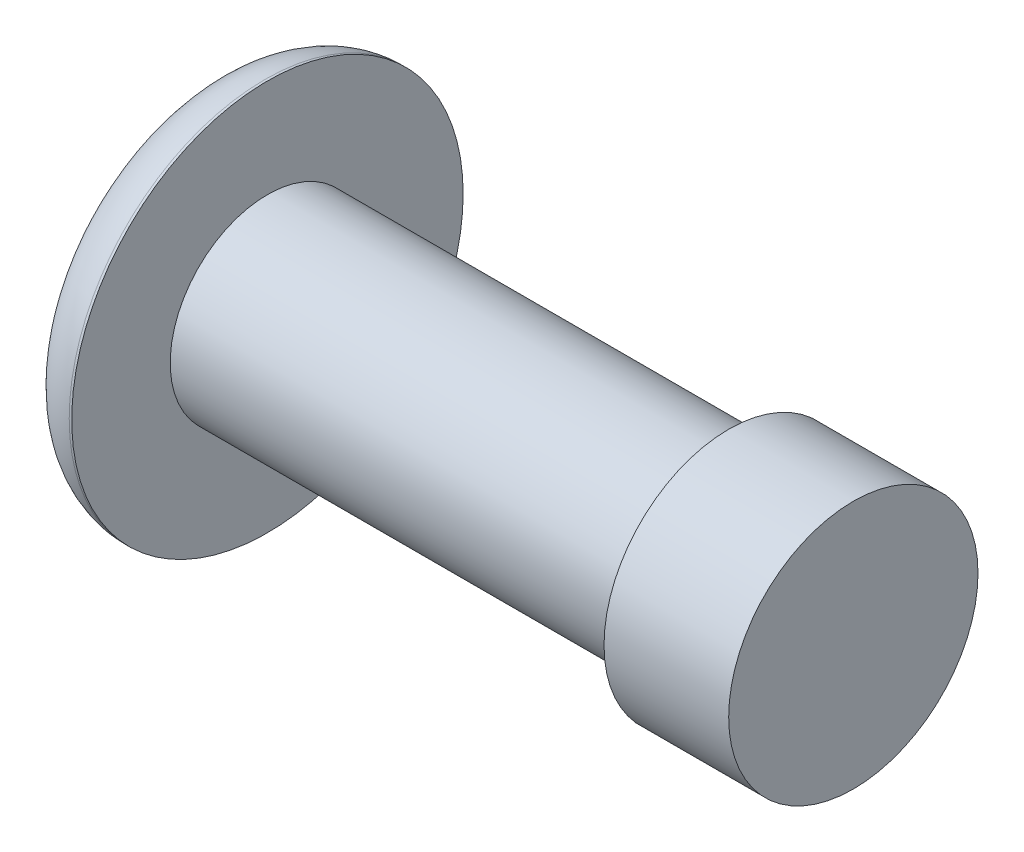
ISO-10303-21;
HEADER;
FILE_DESCRIPTION(('STEP AP214'),'2;1');
FILE_NAME('part.step','',(''),(''),'','','');
FILE_SCHEMA(('AUTOMOTIVE_DESIGN { 1 0 10303 214 1 1 1 1 }'));
ENDSEC;
DATA;
#1=APPLICATION_CONTEXT('core data for automotive mechanical design processes');
#2=APPLICATION_PROTOCOL_DEFINITION('international standard','automotive_design',2000,#1);
#3=PRODUCT_CONTEXT('',#1,'mechanical');
#4=PRODUCT('Part','Part','',(#3));
#5=PRODUCT_RELATED_PRODUCT_CATEGORY('part','',(#4));
#6=PRODUCT_DEFINITION_FORMATION('','',#4);
#7=PRODUCT_DEFINITION_CONTEXT('part definition',#1,'design');
#8=PRODUCT_DEFINITION('design','',#6,#7);
#9=PRODUCT_DEFINITION_SHAPE('','',#8);
#10=(LENGTH_UNIT() NAMED_UNIT(*) SI_UNIT(.MILLI.,.METRE.));
#11=(NAMED_UNIT(*) PLANE_ANGLE_UNIT() SI_UNIT($,.RADIAN.));
#12=(NAMED_UNIT(*) SI_UNIT($,.STERADIAN.) SOLID_ANGLE_UNIT());
#13=UNCERTAINTY_MEASURE_WITH_UNIT(LENGTH_MEASURE(1.E-05),#10,'distance_accuracy_value','');
#14=(GEOMETRIC_REPRESENTATION_CONTEXT(3) GLOBAL_UNCERTAINTY_ASSIGNED_CONTEXT((#13)) GLOBAL_UNIT_ASSIGNED_CONTEXT((#10,
#11,#12)) REPRESENTATION_CONTEXT('',''));
#15=CARTESIAN_POINT('',(0.,0.,0.));
#16=DIRECTION('',(0.,0.,1.));
#17=DIRECTION('',(1.,0.,0.));
#18=AXIS2_PLACEMENT_3D('',#15,#16,#17);
#19=CARTESIAN_POINT('',(0.,0.,0.));
#20=DIRECTION('',(1.,0.,0.));
#21=DIRECTION('',(0.,0.,-1.));
#22=AXIS2_PLACEMENT_3D('',#19,#20,#21);
#23=PLANE('',#22);
#24=CARTESIAN_POINT('',(0.,0.,0.));
#25=DIRECTION('',(1.,0.,0.));
#26=DIRECTION('',(0.,0.,-1.));
#27=AXIS2_PLACEMENT_3D('',#24,#25,#26);
#28=CIRCLE('',#27,2.54);
#29=CARTESIAN_POINT('',(0.,0.,-2.54000000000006));
#30=VERTEX_POINT('',#29);
#31=EDGE_CURVE('E34',#30,#30,#28,.T.);
#32=ORIENTED_EDGE('',*,*,#31,.T.);
#33=EDGE_LOOP('',(#32));
#34=FACE_BOUND('',#33,.T.);
#35=ADVANCED_FACE('F24',(#34),#23,.T.);
#36=CARTESIAN_POINT('',(0.,0.,0.));
#37=DIRECTION('',(1.,0.,0.));
#38=DIRECTION('',(0.,0.,-1.));
#39=AXIS2_PLACEMENT_3D('',#36,#37,#38);
#40=CYLINDRICAL_SURFACE('',#39,2.54);
#41=CARTESIAN_POINT('',(-2.54,0.,0.));
#42=DIRECTION('',(1.,0.,0.));
#43=DIRECTION('',(0.,0.,-1.));
#44=AXIS2_PLACEMENT_3D('',#41,#42,#43);
#45=CIRCLE('',#44,2.54);
#46=CARTESIAN_POINT('',(-2.54,0.,-2.54000000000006));
#47=VERTEX_POINT('',#46);
#48=EDGE_CURVE('E38',#47,#47,#45,.T.);
#49=ORIENTED_EDGE('',*,*,#48,.T.);
#50=EDGE_LOOP('',(#49));
#51=FACE_BOUND('',#50,.T.);
#52=ORIENTED_EDGE('',*,*,#31,.F.);
#53=EDGE_LOOP('',(#52));
#54=FACE_BOUND('',#53,.T.);
#55=ADVANCED_FACE('F69',(#51,#54),#40,.T.);
#56=CARTESIAN_POINT('',(-2.54,2.53999999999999,1.11022302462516E-13));
#57=DIRECTION('',(-1.,0.,0.));
#58=DIRECTION('',(0.,0.,1.));
#59=AXIS2_PLACEMENT_3D('',#56,#57,#58);
#60=PLANE('',#59);
#61=CARTESIAN_POINT('',(-2.54,0.,0.));
#62=DIRECTION('',(1.,0.,0.));
#63=DIRECTION('',(0.,0.,-1.));
#64=AXIS2_PLACEMENT_3D('',#61,#62,#63);
#65=CIRCLE('',#64,1.9812);
#66=CARTESIAN_POINT('',(-2.54,0.,-1.98120000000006));
#67=VERTEX_POINT('',#66);
#68=EDGE_CURVE('E43',#67,#67,#65,.T.);
#69=ORIENTED_EDGE('',*,*,#68,.T.);
#70=EDGE_LOOP('',(#69));
#71=FACE_BOUND('',#70,.T.);
#72=ORIENTED_EDGE('',*,*,#48,.F.);
#73=EDGE_LOOP('',(#72));
#74=FACE_BOUND('',#73,.T.);
#75=ADVANCED_FACE('F74',(#71,#74),#60,.T.);
#76=CARTESIAN_POINT('',(0.,0.,0.));
#77=DIRECTION('',(1.,0.,0.));
#78=DIRECTION('',(0.,0.,-1.));
#79=AXIS2_PLACEMENT_3D('',#76,#77,#78);
#80=CYLINDRICAL_SURFACE('',#79,1.9812);
#81=CARTESIAN_POINT('',(-11.938,0.,0.));
#82=DIRECTION('',(1.,0.,0.));
#83=DIRECTION('',(0.,0.,-1.));
#84=AXIS2_PLACEMENT_3D('',#81,#82,#83);
#85=CIRCLE('',#84,1.9812);
#86=CARTESIAN_POINT('',(-11.938,0.,-1.98120000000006));
#87=VERTEX_POINT('',#86);
#88=EDGE_CURVE('E46',#87,#87,#85,.T.);
#89=ORIENTED_EDGE('',*,*,#88,.T.);
#90=EDGE_LOOP('',(#89));
#91=FACE_BOUND('',#90,.T.);
#92=ORIENTED_EDGE('',*,*,#68,.F.);
#93=EDGE_LOOP('',(#92));
#94=FACE_BOUND('',#93,.T.);
#95=ADVANCED_FACE('F66',(#91,#94),#80,.T.);
#96=CARTESIAN_POINT('',(-11.938,1.98120000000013,0.));
#97=DIRECTION('',(1.,0.,0.));
#98=DIRECTION('',(0.,0.,-1.));
#99=AXIS2_PLACEMENT_3D('',#96,#97,#98);
#100=PLANE('',#99);
#101=CARTESIAN_POINT('',(-11.938,0.,0.));
#102=DIRECTION('',(1.,0.,0.));
#103=DIRECTION('',(0.,0.,-1.));
#104=AXIS2_PLACEMENT_3D('',#101,#102,#103);
#105=CIRCLE('',#104,3.9878);
#106=CARTESIAN_POINT('',(-11.938,0.,-3.98780000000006));
#107=VERTEX_POINT('',#106);
#108=EDGE_CURVE('E49',#107,#107,#105,.T.);
#109=ORIENTED_EDGE('',*,*,#108,.T.);
#110=EDGE_LOOP('',(#109));
#111=FACE_BOUND('',#110,.T.);
#112=ORIENTED_EDGE('',*,*,#88,.F.);
#113=EDGE_LOOP('',(#112));
#114=FACE_BOUND('',#113,.T.);
#115=ADVANCED_FACE('F53',(#111,#114),#100,.T.);
#116=CARTESIAN_POINT('',(0.,0.,0.));
#117=DIRECTION('',(1.,0.,0.));
#118=DIRECTION('',(0.,0.,-1.));
#119=AXIS2_PLACEMENT_3D('',#116,#117,#118);
#120=CYLINDRICAL_SURFACE('',#119,3.9878);
#121=CARTESIAN_POINT('',(-11.9888,0.,0.));
#122=DIRECTION('',(-1.,0.,0.));
#123=DIRECTION('',(0.,0.,1.));
#124=AXIS2_PLACEMENT_3D('',#121,#122,#123);
#125=CIRCLE('',#124,3.9878);
#126=CARTESIAN_POINT('',(-11.9888,0.,3.98779999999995));
#127=VERTEX_POINT('',#126);
#128=EDGE_CURVE('E30',#127,#127,#125,.F.);
#129=ORIENTED_EDGE('',*,*,#128,.T.);
#130=EDGE_LOOP('',(#129));
#131=FACE_BOUND('',#130,.T.);
#132=ORIENTED_EDGE('',*,*,#108,.F.);
#133=EDGE_LOOP('',(#132));
#134=FACE_BOUND('',#133,.T.);
#135=ADVANCED_FACE('F56',(#131,#134),#120,.T.);
#136=CARTESIAN_POINT('',(-13.1318,3.98779999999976,0.));
#137=DIRECTION('',(-1.,0.,0.));
#138=DIRECTION('',(0.,0.,1.));
#139=AXIS2_PLACEMENT_3D('',#136,#137,#138);
#140=PLANE('',#139);
#141=CARTESIAN_POINT('',(-13.1318,0.,0.));
#142=DIRECTION('',(-1.,0.,0.));
#143=DIRECTION('',(0.,0.,1.));
#144=AXIS2_PLACEMENT_3D('',#141,#142,#143);
#145=CIRCLE('',#144,2.8448);
#146=CARTESIAN_POINT('',(-13.1318,0.,2.84479999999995));
#147=VERTEX_POINT('',#146);
#148=EDGE_CURVE('E10',#147,#147,#145,.T.);
#149=ORIENTED_EDGE('',*,*,#148,.T.);
#150=EDGE_LOOP('',(#149));
#151=FACE_BOUND('',#150,.T.);
#152=ADVANCED_FACE('F58',(#151),#140,.T.);
#153=CARTESIAN_POINT('',(-11.9888,0.,0.));
#154=DIRECTION('',(-1.,0.,0.));
#155=DIRECTION('',(0.,0.,1.));
#156=AXIS2_PLACEMENT_3D('',#153,#154,#155);
#157=TOROIDAL_SURFACE('',#156,2.8448,1.143);
#158=ORIENTED_EDGE('',*,*,#148,.F.);
#159=EDGE_LOOP('',(#158));
#160=FACE_BOUND('',#159,.T.);
#161=ORIENTED_EDGE('',*,*,#128,.F.);
#162=EDGE_LOOP('',(#161));
#163=FACE_BOUND('',#162,.T.);
#164=ADVANCED_FACE('F64',(#160,#163),#157,.T.);
#165=CLOSED_SHELL('',(#35,#55,#75,#95,#115,#135,#152,#164));
#166=MANIFOLD_SOLID_BREP('B2',#165);
#167=ADVANCED_BREP_SHAPE_REPRESENTATION('',(#18,#166),#14);
#168=SHAPE_DEFINITION_REPRESENTATION(#9,#167);
ENDSEC;
END-ISO-10303-21;
